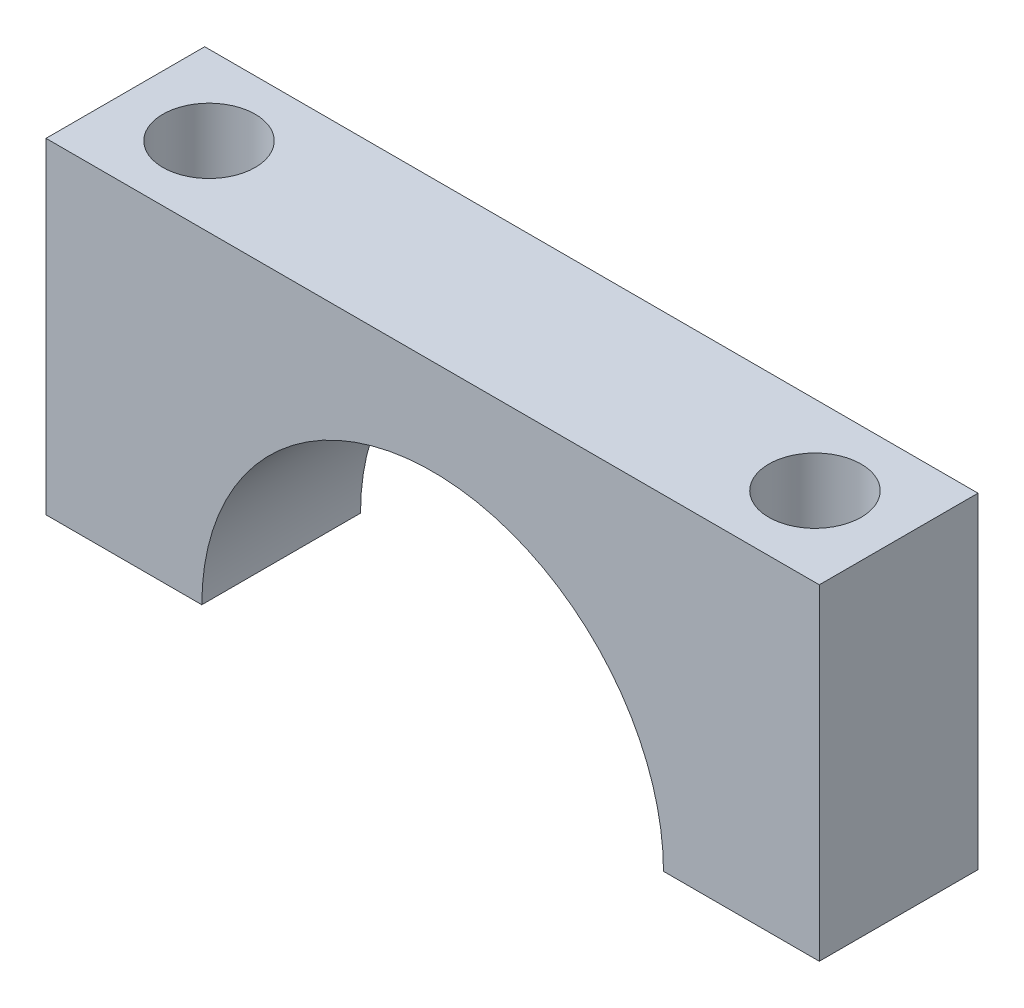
from build123d import *

# Parameters (mm, degrees)
BOSS_EXTRUDE1_DEPTH = 2.75
SKETCH2_R           = 1.6
CUT_EXTRUDE1_DEPTH  = 18.742956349


with BuildPart() as part:
    # Sketch1 → Boss-Extrude1 (new, symmetric)
    with BuildSketch(Plane.XY):
        with BuildLine():
            Line((-13.4, 11.3), (13.4, 11.3))
            Line((13.4, 11.3), (13.4, 0))
            Line((13.4, 0), (8, 0))
            ThreePointArc((8, 0), (0, 8), (-8, 0))
            Line((-8, 0), (-13.4, 0))
            Line((-13.4, 0), (-13.4, 11.3))
        make_face()
    extrude(amount=BOSS_EXTRUDE1_DEPTH, both=True)

    # Sketch2 → Cut-Extrude1 (cut, through all)
    with BuildSketch(Plane.XZ):
        with Locations((-10.5, 0)):
            Circle(SKETCH2_R)
        with Locations((10.5, 0)):
            Circle(SKETCH2_R)
    extrude(amount=-CUT_EXTRUDE1_DEPTH, mode=Mode.SUBTRACT)


solid = part.part
